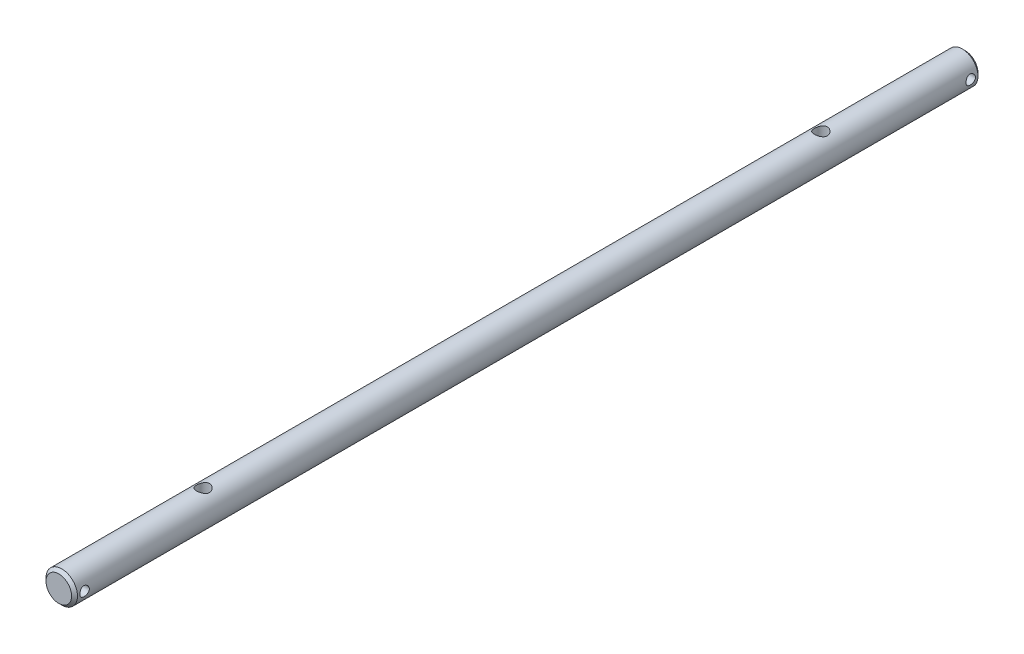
ISO-10303-21;
HEADER;
FILE_DESCRIPTION(('STEP AP214'),'2;1');
FILE_NAME('part.step','',(''),(''),'','','');
FILE_SCHEMA(('AUTOMOTIVE_DESIGN { 1 0 10303 214 1 1 1 1 }'));
ENDSEC;
DATA;
#1=APPLICATION_CONTEXT('core data for automotive mechanical design processes');
#2=APPLICATION_PROTOCOL_DEFINITION('international standard','automotive_design',2000,#1);
#3=PRODUCT_CONTEXT('',#1,'mechanical');
#4=PRODUCT('Part','Part','',(#3));
#5=PRODUCT_RELATED_PRODUCT_CATEGORY('part','',(#4));
#6=PRODUCT_DEFINITION_FORMATION('','',#4);
#7=PRODUCT_DEFINITION_CONTEXT('part definition',#1,'design');
#8=PRODUCT_DEFINITION('design','',#6,#7);
#9=PRODUCT_DEFINITION_SHAPE('','',#8);
#10=(LENGTH_UNIT() NAMED_UNIT(*) SI_UNIT(.MILLI.,.METRE.));
#11=(NAMED_UNIT(*) PLANE_ANGLE_UNIT() SI_UNIT($,.RADIAN.));
#12=(NAMED_UNIT(*) SI_UNIT($,.STERADIAN.) SOLID_ANGLE_UNIT());
#13=UNCERTAINTY_MEASURE_WITH_UNIT(LENGTH_MEASURE(1.E-05),#10,'distance_accuracy_value','');
#14=(GEOMETRIC_REPRESENTATION_CONTEXT(3) GLOBAL_UNCERTAINTY_ASSIGNED_CONTEXT((#13)) GLOBAL_UNIT_ASSIGNED_CONTEXT((#10,
#11,#12)) REPRESENTATION_CONTEXT('',''));
#15=CARTESIAN_POINT('',(0.,0.,0.));
#16=DIRECTION('',(0.,0.,1.));
#17=DIRECTION('',(1.,0.,0.));
#18=AXIS2_PLACEMENT_3D('',#15,#16,#17);
#19=CARTESIAN_POINT('',(0.,0.,457.2));
#20=DIRECTION('',(0.,0.,-1.));
#21=DIRECTION('',(-1.,0.,0.));
#22=AXIS2_PLACEMENT_3D('',#19,#20,#21);
#23=CYLINDRICAL_SURFACE('',#22,7.9375);
#24=CARTESIAN_POINT('',(0.,0.,1.41824457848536));
#25=DIRECTION('',(0.,0.,1.));
#26=DIRECTION('',(1.,0.,0.));
#27=AXIS2_PLACEMENT_3D('',#24,#25,#26);
#28=CIRCLE('',#27,7.9375);
#29=CARTESIAN_POINT('',(7.9375,0.,1.41824457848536));
#30=VERTEX_POINT('',#29);
#31=EDGE_CURVE('E129',#30,#30,#28,.T.);
#32=ORIENTED_EDGE('',*,*,#31,.T.);
#33=EDGE_LOOP('',(#32));
#34=FACE_BOUND('',#33,.T.);
#35=CARTESIAN_POINT('',(0.,-7.9375,387.6929));
#36=CARTESIAN_POINT('',(-0.0875530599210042,-7.93749934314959,387.692899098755));
#37=CARTESIAN_POINT('',(-0.175141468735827,-7.93604590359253,387.689369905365));
#38=CARTESIAN_POINT('',(-0.349674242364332,-7.93027671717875,387.675299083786));
#39=CARTESIAN_POINT('',(-0.436618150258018,-7.92595910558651,387.664752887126));
#40=CARTESIAN_POINT('',(-0.695857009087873,-7.9088288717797,387.622655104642));
#41=CARTESIAN_POINT('',(-0.86631402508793,-7.89183927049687,387.580644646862));
#42=CARTESIAN_POINT('',(-1.19655692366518,-7.84856059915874,387.470636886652));
#43=CARTESIAN_POINT('',(-1.35637647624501,-7.8223027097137,387.402726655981));
#44=CARTESIAN_POINT('',(-1.66224186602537,-7.76306120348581,387.243201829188));
#45=CARTESIAN_POINT('',(-1.808292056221,-7.73007972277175,387.151594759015));
#46=CARTESIAN_POINT('',(-2.0898325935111,-7.65888683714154,386.942516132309));
#47=CARTESIAN_POINT('',(-2.22455413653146,-7.62050707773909,386.824067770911));
#48=CARTESIAN_POINT('',(-2.47288037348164,-7.54358650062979,386.566732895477));
#49=CARTESIAN_POINT('',(-2.58647421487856,-7.50504561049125,386.427835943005));
#50=CARTESIAN_POINT('',(-2.7946567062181,-7.43011705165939,386.125522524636));
#51=CARTESIAN_POINT('',(-2.88808252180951,-7.39391935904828,385.961253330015));
#52=CARTESIAN_POINT('',(-3.04563418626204,-7.33043566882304,385.617625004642));
#53=CARTESIAN_POINT('',(-3.10977473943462,-7.30314520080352,385.438273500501));
#54=CARTESIAN_POINT('',(-3.20378358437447,-7.26238292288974,385.078411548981));
#55=CARTESIAN_POINT('',(-3.23512819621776,-7.24831904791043,384.898356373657));
#56=CARTESIAN_POINT('',(-3.26726348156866,-7.23389512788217,384.535035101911));
#57=CARTESIAN_POINT('',(-3.26807038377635,-7.23352780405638,384.351770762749));
#58=CARTESIAN_POINT('',(-3.24022153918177,-7.24603607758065,384.001762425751));
#59=CARTESIAN_POINT('',(-3.21375012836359,-7.25792988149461,383.834802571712));
#60=CARTESIAN_POINT('',(-3.13575278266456,-7.2919648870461,383.507946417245));
#61=CARTESIAN_POINT('',(-3.08422219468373,-7.3141079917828,383.348051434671));
#62=CARTESIAN_POINT('',(-2.95657151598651,-7.36664257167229,383.035883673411));
#63=CARTESIAN_POINT('',(-2.87995763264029,-7.3971975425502,382.883841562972));
#64=CARTESIAN_POINT('',(-2.70466340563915,-7.4630727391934,382.594190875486));
#65=CARTESIAN_POINT('',(-2.60597449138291,-7.49839481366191,382.456587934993));
#66=CARTESIAN_POINT('',(-2.37981547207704,-7.57335383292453,382.187831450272));
#67=CARTESIAN_POINT('',(-2.25064758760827,-7.61310693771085,382.058135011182));
#68=CARTESIAN_POINT('',(-1.97199073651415,-7.68999570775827,381.821763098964));
#69=CARTESIAN_POINT('',(-1.82249726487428,-7.72713078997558,381.715092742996));
#70=CARTESIAN_POINT('',(-1.50310308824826,-7.79562728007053,381.525739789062));
#71=CARTESIAN_POINT('',(-1.33282650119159,-7.82684408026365,381.44363505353));
#72=CARTESIAN_POINT('',(-0.979267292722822,-7.8788824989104,381.309744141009));
#73=CARTESIAN_POINT('',(-0.795991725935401,-7.89970970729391,381.257941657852));
#74=CARTESIAN_POINT('',(-0.433826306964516,-7.9275865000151,381.189141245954));
#75=CARTESIAN_POINT('',(-0.255367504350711,-7.93540929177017,381.170186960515));
#76=CARTESIAN_POINT('',(0.102336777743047,-7.93885310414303,381.161807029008));
#77=CARTESIAN_POINT('',(0.281582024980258,-7.93447751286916,381.17237318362));
#78=CARTESIAN_POINT('',(0.62670773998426,-7.91451937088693,381.221320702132));
#79=CARTESIAN_POINT('',(0.792816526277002,-7.89948546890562,381.258341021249));
#80=CARTESIAN_POINT('',(1.11629339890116,-7.86030273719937,381.357265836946));
#81=CARTESIAN_POINT('',(1.27366037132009,-7.83615274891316,381.419173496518));
#82=CARTESIAN_POINT('',(1.58067601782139,-7.78013402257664,381.568139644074));
#83=CARTESIAN_POINT('',(1.72993527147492,-7.74804959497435,381.65591700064));
#84=CARTESIAN_POINT('',(2.01213722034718,-7.67960474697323,381.853338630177));
#85=CARTESIAN_POINT('',(2.14507314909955,-7.64324256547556,381.962991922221));
#86=CARTESIAN_POINT('',(2.40058399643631,-7.56704039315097,382.209998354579));
#87=CARTESIAN_POINT('',(2.52179169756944,-7.52713460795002,382.348749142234));
#88=CARTESIAN_POINT('',(2.73956909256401,-7.45063918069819,382.645281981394));
#89=CARTESIAN_POINT('',(2.83613372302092,-7.41405022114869,382.803067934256));
#90=CARTESIAN_POINT('',(3.00277654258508,-7.34815673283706,383.136147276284));
#91=CARTESIAN_POINT('',(3.07250365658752,-7.31895036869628,383.311637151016));
#92=CARTESIAN_POINT('',(3.18084236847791,-7.27252962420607,383.673440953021));
#93=CARTESIAN_POINT('',(3.21947872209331,-7.25530570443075,383.85974614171));
#94=CARTESIAN_POINT('',(3.2621099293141,-7.23623107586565,384.222764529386));
#95=CARTESIAN_POINT('',(3.26849573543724,-7.23331975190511,384.399142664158));
#96=CARTESIAN_POINT('',(3.25279307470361,-7.24039494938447,384.750345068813));
#97=CARTESIAN_POINT('',(3.23070871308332,-7.25037961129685,384.925169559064));
#98=CARTESIAN_POINT('',(3.16068324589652,-7.28116335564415,385.260361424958));
#99=CARTESIAN_POINT('',(3.11392710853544,-7.30146537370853,385.421026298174));
#100=CARTESIAN_POINT('',(2.99702644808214,-7.35021956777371,385.732277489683));
#101=CARTESIAN_POINT('',(2.92687538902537,-7.37867402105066,385.882860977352));
#102=CARTESIAN_POINT('',(2.76038854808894,-7.44261733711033,386.179401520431));
#103=CARTESIAN_POINT('',(2.66274810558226,-7.47842299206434,386.324556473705));
#104=CARTESIAN_POINT('',(2.44589930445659,-7.55212412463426,386.597172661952));
#105=CARTESIAN_POINT('',(2.32668378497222,-7.59002029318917,386.724627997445));
#106=CARTESIAN_POINT('',(2.06016435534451,-7.6668232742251,386.967406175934));
#107=CARTESIAN_POINT('',(1.91147676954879,-7.70561451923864,387.081250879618));
#108=CARTESIAN_POINT('',(1.59555365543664,-7.77716179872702,387.282465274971));
#109=CARTESIAN_POINT('',(1.42830967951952,-7.80991506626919,387.369822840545));
#110=CARTESIAN_POINT('',(1.16866980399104,-7.85147733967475,387.477915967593));
#111=CARTESIAN_POINT('',(1.08141427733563,-7.86399724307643,387.509950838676));
#112=CARTESIAN_POINT('',(0.904186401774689,-7.88633656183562,387.566534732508));
#113=CARTESIAN_POINT('',(0.814215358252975,-7.89615725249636,387.59108729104));
#114=CARTESIAN_POINT('',(0.632474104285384,-7.91278688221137,387.632386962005));
#115=CARTESIAN_POINT('',(0.540708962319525,-7.91960330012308,387.649153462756));
#116=CARTESIAN_POINT('',(0.355946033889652,-7.93005394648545,387.674771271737));
#117=CARTESIAN_POINT('',(0.262949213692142,-7.93369053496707,387.683628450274));
#118=CARTESIAN_POINT('',(0.14148373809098,-7.93628946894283,387.689955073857));
#119=CARTESIAN_POINT('',(0.113201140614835,-7.93674317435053,387.69105911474));
#120=CARTESIAN_POINT('',(0.0566135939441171,-7.93734854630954,387.692531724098));
#121=CARTESIAN_POINT('',(0.0283086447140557,-7.9375002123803,387.692900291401));
#122=CARTESIAN_POINT('',(0.,-7.9375,387.6929));
#123=B_SPLINE_CURVE_WITH_KNOTS('',3,(#35,#36,#37,#38,#39,#40,#41,#42,#43,#44,#45,#46,#47,#48,
#49,#50,#51,#52,#53,#54,#55,#56,#57,#58,#59,#60,#61,#62,#63,#64,#65,#66,#67,#68,#69,#70,#71,#72,
#73,#74,#75,#76,#77,#78,#79,#80,#81,#82,#83,#84,#85,#86,#87,#88,#89,#90,#91,#92,#93,#94,#95,#96,
#97,#98,#99,#100,#101,#102,#103,#104,#105,#106,#107,#108,#109,#110,#111,#112,#113,#114,#115,
#116,#117,#118,#119,#120,#121,#122),.UNSPECIFIED.,.T.,.F.,(4,2,2,2,2,2,2,2,2,2,2,2,2,2,2,2,2,2,
2,2,2,2,2,2,2,2,2,2,2,2,2,2,2,2,2,2,2,2,2,2,2,2,2,4),(0.,0.262627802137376,0.525426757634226,
1.05175013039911,1.57631944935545,2.10072237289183,2.64867604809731,3.19691041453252,
3.77125564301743,4.34531217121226,4.89224140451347,5.43887997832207,5.94490860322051,
6.45103122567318,6.96778553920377,7.48474083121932,8.04414010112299,8.60366356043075,
9.17546733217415,9.74696312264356,10.2830744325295,10.8190368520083,11.329243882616,
11.8395157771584,12.3655746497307,12.891850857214,13.4547946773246,14.0178540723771,
14.5880472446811,15.1577859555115,15.6845933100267,16.2113247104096,16.7147943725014,
17.2184048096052,17.7518396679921,18.2854519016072,18.8564940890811,19.4277973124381,
19.7088571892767,19.98978404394,20.2700075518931,20.5500229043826,20.6349385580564,
20.71985434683),.UNSPECIFIED.);
#124=CARTESIAN_POINT('',(0.,-7.9375,387.6929));
#125=VERTEX_POINT('',#124);
#126=EDGE_CURVE('E10',#125,#125,#123,.T.);
#127=ORIENTED_EDGE('',*,*,#126,.F.);
#128=EDGE_LOOP('',(#127));
#129=FACE_BOUND('',#128,.T.);
#130=CARTESIAN_POINT('',(0.,7.9375,387.6929));
#131=CARTESIAN_POINT('',(0.0875530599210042,7.93749934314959,387.692899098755));
#132=CARTESIAN_POINT('',(0.175141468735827,7.93604590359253,387.689369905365));
#133=CARTESIAN_POINT('',(0.349674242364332,7.93027671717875,387.675299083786));
#134=CARTESIAN_POINT('',(0.436618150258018,7.92595910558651,387.664752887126));
#135=CARTESIAN_POINT('',(0.695857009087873,7.9088288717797,387.622655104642));
#136=CARTESIAN_POINT('',(0.86631402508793,7.89183927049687,387.580644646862));
#137=CARTESIAN_POINT('',(1.19655692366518,7.84856059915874,387.470636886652));
#138=CARTESIAN_POINT('',(1.35637647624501,7.8223027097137,387.402726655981));
#139=CARTESIAN_POINT('',(1.66224186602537,7.76306120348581,387.243201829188));
#140=CARTESIAN_POINT('',(1.808292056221,7.73007972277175,387.151594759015));
#141=CARTESIAN_POINT('',(2.0898325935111,7.65888683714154,386.942516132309));
#142=CARTESIAN_POINT('',(2.22455413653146,7.62050707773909,386.824067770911));
#143=CARTESIAN_POINT('',(2.47288037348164,7.54358650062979,386.566732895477));
#144=CARTESIAN_POINT('',(2.58647421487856,7.50504561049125,386.427835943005));
#145=CARTESIAN_POINT('',(2.7946567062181,7.43011705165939,386.125522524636));
#146=CARTESIAN_POINT('',(2.88808252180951,7.39391935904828,385.961253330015));
#147=CARTESIAN_POINT('',(3.04563418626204,7.33043566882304,385.617625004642));
#148=CARTESIAN_POINT('',(3.10977473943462,7.30314520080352,385.438273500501));
#149=CARTESIAN_POINT('',(3.20378358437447,7.26238292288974,385.078411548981));
#150=CARTESIAN_POINT('',(3.23512819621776,7.24831904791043,384.898356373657));
#151=CARTESIAN_POINT('',(3.26726348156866,7.23389512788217,384.535035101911));
#152=CARTESIAN_POINT('',(3.26807038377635,7.23352780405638,384.351770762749));
#153=CARTESIAN_POINT('',(3.24022153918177,7.24603607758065,384.001762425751));
#154=CARTESIAN_POINT('',(3.21375012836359,7.25792988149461,383.834802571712));
#155=CARTESIAN_POINT('',(3.13575278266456,7.2919648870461,383.507946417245));
#156=CARTESIAN_POINT('',(3.08422219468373,7.3141079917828,383.348051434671));
#157=CARTESIAN_POINT('',(2.95657151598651,7.36664257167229,383.035883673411));
#158=CARTESIAN_POINT('',(2.87995763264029,7.3971975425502,382.883841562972));
#159=CARTESIAN_POINT('',(2.70466340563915,7.4630727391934,382.594190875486));
#160=CARTESIAN_POINT('',(2.60597449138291,7.49839481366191,382.456587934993));
#161=CARTESIAN_POINT('',(2.37981547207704,7.57335383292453,382.187831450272));
#162=CARTESIAN_POINT('',(2.25064758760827,7.61310693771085,382.058135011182));
#163=CARTESIAN_POINT('',(1.97199073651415,7.68999570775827,381.821763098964));
#164=CARTESIAN_POINT('',(1.82249726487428,7.72713078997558,381.715092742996));
#165=CARTESIAN_POINT('',(1.50310308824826,7.79562728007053,381.525739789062));
#166=CARTESIAN_POINT('',(1.33282650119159,7.82684408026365,381.44363505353));
#167=CARTESIAN_POINT('',(0.979267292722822,7.8788824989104,381.309744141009));
#168=CARTESIAN_POINT('',(0.795991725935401,7.89970970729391,381.257941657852));
#169=CARTESIAN_POINT('',(0.433826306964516,7.9275865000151,381.189141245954));
#170=CARTESIAN_POINT('',(0.255367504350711,7.93540929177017,381.170186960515));
#171=CARTESIAN_POINT('',(-0.102336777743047,7.93885310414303,381.161807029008));
#172=CARTESIAN_POINT('',(-0.281582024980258,7.93447751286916,381.17237318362));
#173=CARTESIAN_POINT('',(-0.62670773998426,7.91451937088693,381.221320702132));
#174=CARTESIAN_POINT('',(-0.792816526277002,7.89948546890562,381.258341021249));
#175=CARTESIAN_POINT('',(-1.11629339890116,7.86030273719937,381.357265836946));
#176=CARTESIAN_POINT('',(-1.27366037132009,7.83615274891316,381.419173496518));
#177=CARTESIAN_POINT('',(-1.58067601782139,7.78013402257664,381.568139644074));
#178=CARTESIAN_POINT('',(-1.72993527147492,7.74804959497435,381.65591700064));
#179=CARTESIAN_POINT('',(-2.01213722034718,7.67960474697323,381.853338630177));
#180=CARTESIAN_POINT('',(-2.14507314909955,7.64324256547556,381.962991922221));
#181=CARTESIAN_POINT('',(-2.40058399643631,7.56704039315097,382.209998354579));
#182=CARTESIAN_POINT('',(-2.52179169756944,7.52713460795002,382.348749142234));
#183=CARTESIAN_POINT('',(-2.73956909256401,7.45063918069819,382.645281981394));
#184=CARTESIAN_POINT('',(-2.83613372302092,7.41405022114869,382.803067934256));
#185=CARTESIAN_POINT('',(-3.00277654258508,7.34815673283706,383.136147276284));
#186=CARTESIAN_POINT('',(-3.07250365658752,7.31895036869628,383.311637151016));
#187=CARTESIAN_POINT('',(-3.18084236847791,7.27252962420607,383.673440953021));
#188=CARTESIAN_POINT('',(-3.21947872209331,7.25530570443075,383.85974614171));
#189=CARTESIAN_POINT('',(-3.2621099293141,7.23623107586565,384.222764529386));
#190=CARTESIAN_POINT('',(-3.26849573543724,7.23331975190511,384.399142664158));
#191=CARTESIAN_POINT('',(-3.25279307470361,7.24039494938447,384.750345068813));
#192=CARTESIAN_POINT('',(-3.23070871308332,7.25037961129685,384.925169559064));
#193=CARTESIAN_POINT('',(-3.16068324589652,7.28116335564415,385.260361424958));
#194=CARTESIAN_POINT('',(-3.11392710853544,7.30146537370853,385.421026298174));
#195=CARTESIAN_POINT('',(-2.99702644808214,7.35021956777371,385.732277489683));
#196=CARTESIAN_POINT('',(-2.92687538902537,7.37867402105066,385.882860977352));
#197=CARTESIAN_POINT('',(-2.76038854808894,7.44261733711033,386.179401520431));
#198=CARTESIAN_POINT('',(-2.66274810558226,7.47842299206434,386.324556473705));
#199=CARTESIAN_POINT('',(-2.44589930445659,7.55212412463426,386.597172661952));
#200=CARTESIAN_POINT('',(-2.32668378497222,7.59002029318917,386.724627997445));
#201=CARTESIAN_POINT('',(-2.06016435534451,7.6668232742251,386.967406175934));
#202=CARTESIAN_POINT('',(-1.91147676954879,7.70561451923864,387.081250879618));
#203=CARTESIAN_POINT('',(-1.59555365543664,7.77716179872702,387.282465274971));
#204=CARTESIAN_POINT('',(-1.42830967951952,7.80991506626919,387.369822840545));
#205=CARTESIAN_POINT('',(-1.16866980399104,7.85147733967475,387.477915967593));
#206=CARTESIAN_POINT('',(-1.08141427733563,7.86399724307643,387.509950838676));
#207=CARTESIAN_POINT('',(-0.904186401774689,7.88633656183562,387.566534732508));
#208=CARTESIAN_POINT('',(-0.814215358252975,7.89615725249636,387.59108729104));
#209=CARTESIAN_POINT('',(-0.632474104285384,7.91278688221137,387.632386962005));
#210=CARTESIAN_POINT('',(-0.540708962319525,7.91960330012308,387.649153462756));
#211=CARTESIAN_POINT('',(-0.355946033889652,7.93005394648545,387.674771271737));
#212=CARTESIAN_POINT('',(-0.262949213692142,7.93369053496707,387.683628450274));
#213=CARTESIAN_POINT('',(-0.14148373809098,7.93628946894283,387.689955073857));
#214=CARTESIAN_POINT('',(-0.113201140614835,7.93674317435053,387.69105911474));
#215=CARTESIAN_POINT('',(-0.0566135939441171,7.93734854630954,387.692531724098));
#216=CARTESIAN_POINT('',(-0.0283086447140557,7.9375002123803,387.692900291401));
#217=CARTESIAN_POINT('',(0.,7.9375,387.6929));
#218=B_SPLINE_CURVE_WITH_KNOTS('',3,(#130,#131,#132,#133,#134,#135,#136,#137,#138,#139,#140,
#141,#142,#143,#144,#145,#146,#147,#148,#149,#150,#151,#152,#153,#154,#155,#156,#157,#158,#159,
#160,#161,#162,#163,#164,#165,#166,#167,#168,#169,#170,#171,#172,#173,#174,#175,#176,#177,#178,
#179,#180,#181,#182,#183,#184,#185,#186,#187,#188,#189,#190,#191,#192,#193,#194,#195,#196,#197,
#198,#199,#200,#201,#202,#203,#204,#205,#206,#207,#208,#209,#210,#211,#212,#213,#214,#215,#216,
#217),.UNSPECIFIED.,.T.,.F.,(4,2,2,2,2,2,2,2,2,2,2,2,2,2,2,2,2,2,2,2,2,2,2,2,2,2,2,2,2,2,2,2,2,
2,2,2,2,2,2,2,2,2,2,4),(0.,0.262627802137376,0.525426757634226,1.05175013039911,
1.57631944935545,2.10072237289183,2.64867604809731,3.19691041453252,3.77125564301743,
4.34531217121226,4.89224140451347,5.43887997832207,5.94490860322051,6.45103122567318,
6.96778553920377,7.48474083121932,8.04414010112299,8.60366356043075,9.17546733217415,
9.74696312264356,10.2830744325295,10.8190368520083,11.329243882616,11.8395157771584,
12.3655746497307,12.891850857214,13.4547946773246,14.0178540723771,14.5880472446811,
15.1577859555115,15.6845933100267,16.2113247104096,16.7147943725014,17.2184048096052,
17.7518396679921,18.2854519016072,18.8564940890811,19.4277973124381,19.7088571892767,
19.98978404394,20.2700075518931,20.5500229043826,20.6349385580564,20.71985434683),.UNSPECIFIED.);
#219=CARTESIAN_POINT('',(0.,7.9375,387.6929));
#220=VERTEX_POINT('',#219);
#221=EDGE_CURVE('E40',#220,#220,#218,.T.);
#222=ORIENTED_EDGE('',*,*,#221,.F.);
#223=EDGE_LOOP('',(#222));
#224=FACE_BOUND('',#223,.T.);
#225=CARTESIAN_POINT('',(-7.9375,0.,454.496487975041));
#226=CARTESIAN_POINT('',(-7.93749885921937,0.130060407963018,454.504724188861));
#227=CARTESIAN_POINT('',(-7.93427273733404,0.260814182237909,454.502252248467));
#228=CARTESIAN_POINT('',(-7.92151980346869,0.519870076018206,454.476033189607));
#229=CARTESIAN_POINT('',(-7.91199142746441,0.648171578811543,454.45228078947));
#230=CARTESIAN_POINT('',(-7.8874829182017,0.898513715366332,454.384432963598));
#231=CARTESIAN_POINT('',(-7.87251040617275,1.02056283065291,454.34036595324));
#232=CARTESIAN_POINT('',(-7.83848643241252,1.25544317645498,454.233330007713));
#233=CARTESIAN_POINT('',(-7.81943439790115,1.36827310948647,454.170358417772));
#234=CARTESIAN_POINT('',(-7.77849192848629,1.58474696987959,454.025450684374));
#235=CARTESIAN_POINT('',(-7.75654140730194,1.68808252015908,453.943071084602));
#236=CARTESIAN_POINT('',(-7.71234166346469,1.8797293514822,453.762418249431));
#237=CARTESIAN_POINT('',(-7.690092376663,1.96803734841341,453.664141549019));
#238=CARTESIAN_POINT('',(-7.64691682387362,2.12974017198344,453.450961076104));
#239=CARTESIAN_POINT('',(-7.6260488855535,2.20261869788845,453.335652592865));
#240=CARTESIAN_POINT('',(-7.58876151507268,2.32785252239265,453.093714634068));
#241=CARTESIAN_POINT('',(-7.57234121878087,2.38021180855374,452.967087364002));
#242=CARTESIAN_POINT('',(-7.54627824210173,2.46158237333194,452.709220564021));
#243=CARTESIAN_POINT('',(-7.53648279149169,2.49112233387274,452.578163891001));
#244=CARTESIAN_POINT('',(-7.52428089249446,2.5277442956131,452.312628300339));
#245=CARTESIAN_POINT('',(-7.52187192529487,2.53483395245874,452.178150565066));
#246=CARTESIAN_POINT('',(-7.52467951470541,2.52648169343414,451.916141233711));
#247=CARTESIAN_POINT('',(-7.52955374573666,2.51205132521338,451.788572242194));
#248=CARTESIAN_POINT('',(-7.54572894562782,2.46303428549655,451.537799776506));
#249=CARTESIAN_POINT('',(-7.55703023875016,2.42844659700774,451.414596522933));
#250=CARTESIAN_POINT('',(-7.58483517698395,2.34015242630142,451.17545363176));
#251=CARTESIAN_POINT('',(-7.60135507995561,2.28638612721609,451.059538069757));
#252=CARTESIAN_POINT('',(-7.63784758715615,2.161346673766,450.838164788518));
#253=CARTESIAN_POINT('',(-7.65782103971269,2.09006921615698,450.732709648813));
#254=CARTESIAN_POINT('',(-7.70022844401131,1.92813362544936,450.530017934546));
#255=CARTESIAN_POINT('',(-7.72273369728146,1.83672679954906,450.43339382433));
#256=CARTESIAN_POINT('',(-7.76709318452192,1.6390304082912,450.256594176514));
#257=CARTESIAN_POINT('',(-7.78894730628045,1.53273829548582,450.176421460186));
#258=CARTESIAN_POINT('',(-7.83029675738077,1.30536765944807,450.033104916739));
#259=CARTESIAN_POINT('',(-7.84972874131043,1.18401262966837,449.970379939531));
#260=CARTESIAN_POINT('',(-7.88364572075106,0.931773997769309,449.86642739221));
#261=CARTESIAN_POINT('',(-7.89813187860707,0.800892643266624,449.825194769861));
#262=CARTESIAN_POINT('',(-7.92034853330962,0.537509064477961,449.766654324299));
#263=CARTESIAN_POINT('',(-7.92827020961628,0.405175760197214,449.748660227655));
#264=CARTESIAN_POINT('',(-7.93739524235,0.139144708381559,449.735057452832));
#265=CARTESIAN_POINT('',(-7.93860006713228,0.0054472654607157,449.739443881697));
#266=CARTESIAN_POINT('',(-7.93444336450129,-0.254718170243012,449.76995546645));
#267=CARTESIAN_POINT('',(-7.92930287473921,-0.381277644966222,449.795339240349));
#268=CARTESIAN_POINT('',(-7.91356058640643,-0.628327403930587,449.866057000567));
#269=CARTESIAN_POINT('',(-7.9029584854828,-0.748817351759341,449.911392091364));
#270=CARTESIAN_POINT('',(-7.87743576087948,-0.981727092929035,450.021164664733));
#271=CARTESIAN_POINT('',(-7.86247308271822,-1.09405431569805,450.085788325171));
#272=CARTESIAN_POINT('',(-7.82997081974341,-1.30653506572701,450.2321461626));
#273=CARTESIAN_POINT('',(-7.81243065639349,-1.40668585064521,450.313884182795));
#274=CARTESIAN_POINT('',(-7.77604605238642,-1.5958183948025,450.495661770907));
#275=CARTESIAN_POINT('',(-7.75717737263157,-1.68425837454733,450.596260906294));
#276=CARTESIAN_POINT('',(-7.72096440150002,-1.84317018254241,450.811032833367));
#277=CARTESIAN_POINT('',(-7.70362023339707,-1.91364055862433,450.925206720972));
#278=CARTESIAN_POINT('',(-7.67242891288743,-2.03512359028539,451.165244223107));
#279=CARTESIAN_POINT('',(-7.65861420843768,-2.08595775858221,451.291202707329));
#280=CARTESIAN_POINT('',(-7.63649057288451,-2.16555899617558,451.550361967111));
#281=CARTESIAN_POINT('',(-7.62818006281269,-2.19433239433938,451.683560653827));
#282=CARTESIAN_POINT('',(-7.61835876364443,-2.2281871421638,451.948656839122));
#283=CARTESIAN_POINT('',(-7.61663048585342,-2.23402648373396,452.080449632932));
#284=CARTESIAN_POINT('',(-7.61959525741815,-2.2238934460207,452.34311018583));
#285=CARTESIAN_POINT('',(-7.62428764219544,-2.20792332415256,452.473978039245));
#286=CARTESIAN_POINT('',(-7.6393250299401,-2.1553041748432,452.728315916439));
#287=CARTESIAN_POINT('',(-7.64955233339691,-2.11908522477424,452.851882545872));
#288=CARTESIAN_POINT('',(-7.67434774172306,-2.02744483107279,453.091207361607));
#289=CARTESIAN_POINT('',(-7.68891649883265,-1.97202050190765,453.206964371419));
#290=CARTESIAN_POINT('',(-7.72114806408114,-1.84184071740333,453.430741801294));
#291=CARTESIAN_POINT('',(-7.73888239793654,-1.76661357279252,453.538477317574));
#292=CARTESIAN_POINT('',(-7.77512584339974,-1.59956724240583,453.74008947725));
#293=CARTESIAN_POINT('',(-7.79363515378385,-1.50774377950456,453.83396253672));
#294=CARTESIAN_POINT('',(-7.82988164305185,-1.30674663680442,454.008104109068));
#295=CARTESIAN_POINT('',(-7.84757796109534,-1.19712862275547,454.087869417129));
#296=CARTESIAN_POINT('',(-7.87941367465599,-0.965591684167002,454.227824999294));
#297=CARTESIAN_POINT('',(-7.8935544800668,-0.843677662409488,454.288023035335));
#298=CARTESIAN_POINT('',(-7.91538795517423,-0.603080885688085,454.382187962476));
#299=CARTESIAN_POINT('',(-7.92356846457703,-0.485206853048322,454.418114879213));
#300=CARTESIAN_POINT('',(-7.9346245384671,-0.245094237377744,454.471373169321));
#301=CARTESIAN_POINT('',(-7.93750107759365,-0.122856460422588,454.488707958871));
#302=CARTESIAN_POINT('',(-7.9375,0.,454.496487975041));
#303=B_SPLINE_CURVE_WITH_KNOTS('',3,(#225,#226,#227,#228,#229,#230,#231,#232,#233,#234,#235,
#236,#237,#238,#239,#240,#241,#242,#243,#244,#245,#246,#247,#248,#249,#250,#251,#252,#253,#254,
#255,#256,#257,#258,#259,#260,#261,#262,#263,#264,#265,#266,#267,#268,#269,#270,#271,#272,#273,
#274,#275,#276,#277,#278,#279,#280,#281,#282,#283,#284,#285,#286,#287,#288,#289,#290,#291,#292,
#293,#294,#295,#296,#297,#298,#299,#300,#301,#302),.UNSPECIFIED.,.T.,.F.,(4,2,2,2,2,2,2,2,2,2,2,
2,2,2,2,2,2,2,2,2,2,2,2,2,2,2,2,2,2,2,2,2,2,2,2,2,2,2,4),(0.,0.390513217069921,
0.781123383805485,1.17118882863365,1.56130907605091,1.96139739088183,2.36157302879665,
2.7735441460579,3.18543516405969,3.58747066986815,3.98936906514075,4.37296201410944,
4.75657431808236,5.14139369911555,5.52630774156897,5.92916895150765,6.3320991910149,
6.74399984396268,7.15580362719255,7.55514499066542,7.95439905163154,8.34012930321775,
8.72588091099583,9.11548340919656,9.50517349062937,9.90910168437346,10.3130625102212,
10.7206133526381,11.1280472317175,11.5218957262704,11.9157034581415,12.3014483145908,
12.6872511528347,13.0832386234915,13.4793282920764,13.8875179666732,14.2955455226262,
14.6644963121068,15.0333792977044),.UNSPECIFIED.);
#304=CARTESIAN_POINT('',(-7.9375,0.,454.496487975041));
#305=VERTEX_POINT('',#304);
#306=EDGE_CURVE('E83',#305,#305,#303,.T.);
#307=ORIENTED_EDGE('',*,*,#306,.F.);
#308=EDGE_LOOP('',(#307));
#309=FACE_BOUND('',#308,.T.);
#310=CARTESIAN_POINT('',(7.93607269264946,0.150520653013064,449.73875));
#311=CARTESIAN_POINT('',(7.93358511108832,0.281603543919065,449.738751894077));
#312=CARTESIAN_POINT('',(7.92782086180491,0.412643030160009,449.749610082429));
#313=CARTESIAN_POINT('',(7.91016586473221,0.670778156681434,449.792593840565));
#314=CARTESIAN_POINT('',(7.89827294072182,0.79787237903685,449.824726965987));
#315=CARTESIAN_POINT('',(7.86947235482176,1.04436357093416,449.909041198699));
#316=CARTESIAN_POINT('',(7.85257287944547,1.16377272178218,449.961189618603));
#317=CARTESIAN_POINT('',(7.815327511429,1.39210723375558,450.083919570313));
#318=CARTESIAN_POINT('',(7.79498117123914,1.50103123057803,450.154503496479));
#319=CARTESIAN_POINT('',(7.75214805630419,1.70870506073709,450.314433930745));
#320=CARTESIAN_POINT('',(7.72961715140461,1.80708218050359,450.404252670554));
#321=CARTESIAN_POINT('',(7.68518071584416,1.98760248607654,450.599103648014));
#322=CARTESIAN_POINT('',(7.66327529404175,2.06974286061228,450.704138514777));
#323=CARTESIAN_POINT('',(7.62196578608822,2.21710135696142,450.929179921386));
#324=CARTESIAN_POINT('',(7.60262318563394,2.28193207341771,451.049452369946));
#325=CARTESIAN_POINT('',(7.56926567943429,2.39026369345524,451.299935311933));
#326=CARTESIAN_POINT('',(7.55524921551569,2.43377083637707,451.43014288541));
#327=CARTESIAN_POINT('',(7.53466635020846,2.49675386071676,451.692131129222));
#328=CARTESIAN_POINT('',(7.52786368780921,2.51699379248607,451.823709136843));
#329=CARTESIAN_POINT('',(7.52173372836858,2.53525744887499,452.088555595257));
#330=CARTESIAN_POINT('',(7.52240442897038,2.5332871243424,452.221823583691));
#331=CARTESIAN_POINT('',(7.53095152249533,2.50775456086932,452.480594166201));
#332=CARTESIAN_POINT('',(7.53853755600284,2.48506232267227,452.606193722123));
#333=CARTESIAN_POINT('',(7.55963401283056,2.42012272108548,452.851700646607));
#334=CARTESIAN_POINT('',(7.57314506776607,2.377873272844,452.971607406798));
#335=CARTESIAN_POINT('',(7.60487693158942,2.2743598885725,453.204507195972));
#336=CARTESIAN_POINT('',(7.62316828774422,2.2128081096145,453.317362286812));
#337=CARTESIAN_POINT('',(7.66245868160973,2.07265956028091,453.531421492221));
#338=CARTESIAN_POINT('',(7.68345843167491,1.99405830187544,453.63262252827));
#339=CARTESIAN_POINT('',(7.72713690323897,1.81765948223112,453.825543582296));
#340=CARTESIAN_POINT('',(7.74984803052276,1.71912876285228,453.91658706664));
#341=CARTESIAN_POINT('',(7.79368696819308,1.50796664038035,454.081020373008));
#342=CARTESIAN_POINT('',(7.8148146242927,1.39533386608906,454.154408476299));
#343=CARTESIAN_POINT('',(7.85358156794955,1.15750515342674,454.282115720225));
#344=CARTESIAN_POINT('',(7.87117983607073,1.03218441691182,454.336215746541));
#345=CARTESIAN_POINT('',(7.90078710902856,0.773551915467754,454.422334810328));
#346=CARTESIAN_POINT('',(7.91279769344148,0.640242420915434,454.454360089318));
#347=CARTESIAN_POINT('',(7.92973078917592,0.374617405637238,454.494343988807));
#348=CARTESIAN_POINT('',(7.93489587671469,0.24244301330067,454.503137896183));
#349=CARTESIAN_POINT('',(7.93856815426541,-0.0216157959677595,454.498686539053));
#350=CARTESIAN_POINT('',(7.93707642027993,-0.153500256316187,454.48544483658));
#351=CARTESIAN_POINT('',(7.92793719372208,-0.409508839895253,454.438019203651));
#352=CARTESIAN_POINT('',(7.92045703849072,-0.533746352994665,454.404410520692));
#353=CARTESIAN_POINT('',(7.90051665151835,-0.774846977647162,454.317830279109));
#354=CARTESIAN_POINT('',(7.88805592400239,-0.891709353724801,454.264856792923));
#355=CARTESIAN_POINT('',(7.85932081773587,-1.11720969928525,454.139935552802));
#356=CARTESIAN_POINT('',(7.84297892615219,-1.22565091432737,454.067648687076));
#357=CARTESIAN_POINT('',(7.80846140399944,-1.42916369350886,453.906561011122));
#358=CARTESIAN_POINT('',(7.79028534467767,-1.52423211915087,453.817756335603));
#359=CARTESIAN_POINT('',(7.75347612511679,-1.701773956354,453.62245672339));
#360=CARTESIAN_POINT('',(7.73484944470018,-1.78368508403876,453.515448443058));
#361=CARTESIAN_POINT('',(7.70003293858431,-1.92846130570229,453.288870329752));
#362=CARTESIAN_POINT('',(7.68384309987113,-1.99132650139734,453.169300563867));
#363=CARTESIAN_POINT('',(7.65594640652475,-2.0960299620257,452.92093490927));
#364=CARTESIAN_POINT('',(7.64423431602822,-2.13789280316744,452.792150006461));
#365=CARTESIAN_POINT('',(7.62681609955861,-2.19923115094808,452.528974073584));
#366=CARTESIAN_POINT('',(7.62110819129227,-2.21871330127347,452.394584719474));
#367=CARTESIAN_POINT('',(7.61655756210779,-2.23428207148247,452.129255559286));
#368=CARTESIAN_POINT('',(7.6174730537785,-2.23119262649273,451.998367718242));
#369=CARTESIAN_POINT('',(7.62547882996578,-2.20367409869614,451.739057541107));
#370=CARTESIAN_POINT('',(7.63256889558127,-2.17924577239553,451.610635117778));
#371=CARTESIAN_POINT('',(7.65191757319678,-2.11028787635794,451.361283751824));
#372=CARTESIAN_POINT('',(7.66411810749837,-2.06598379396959,451.240287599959));
#373=CARTESIAN_POINT('',(7.69223402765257,-1.95869931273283,451.007348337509));
#374=CARTESIAN_POINT('',(7.70815007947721,-1.89571556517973,450.895406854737));
#375=CARTESIAN_POINT('',(7.74245180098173,-1.75045107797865,450.679828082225));
#376=CARTESIAN_POINT('',(7.76090083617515,-1.66761062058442,450.57657798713));
#377=CARTESIAN_POINT('',(7.79771481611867,-1.48597527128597,450.385166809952));
#378=CARTESIAN_POINT('',(7.81607974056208,-1.38717671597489,450.297009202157));
#379=CARTESIAN_POINT('',(7.85102490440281,-1.17357760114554,450.136215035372));
#380=CARTESIAN_POINT('',(7.86755243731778,-1.05845288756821,450.063996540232));
#381=CARTESIAN_POINT('',(7.89625337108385,-0.817194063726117,449.940034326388));
#382=CARTESIAN_POINT('',(7.90842897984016,-0.691065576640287,449.888280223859));
#383=CARTESIAN_POINT('',(7.92576959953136,-0.446476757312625,449.811661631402));
#384=CARTESIAN_POINT('',(7.93158210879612,-0.328814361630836,449.7843810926));
#385=CARTESIAN_POINT('',(7.93787697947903,-0.0905819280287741,449.747925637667));
#386=CARTESIAN_POINT('',(7.93836006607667,0.0299877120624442,449.738748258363));
#387=CARTESIAN_POINT('',(7.93607269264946,0.150520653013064,449.73875));
#388=B_SPLINE_CURVE_WITH_KNOTS('',3,(#310,#311,#312,#313,#314,#315,#316,#317,#318,#319,#320,
#321,#322,#323,#324,#325,#326,#327,#328,#329,#330,#331,#332,#333,#334,#335,#336,#337,#338,#339,
#340,#341,#342,#343,#344,#345,#346,#347,#348,#349,#350,#351,#352,#353,#354,#355,#356,#357,#358,
#359,#360,#361,#362,#363,#364,#365,#366,#367,#368,#369,#370,#371,#372,#373,#374,#375,#376,#377,
#378,#379,#380,#381,#382,#383,#384,#385,#386,#387),.UNSPECIFIED.,.T.,.F.,(4,2,2,2,2,2,2,2,2,2,2,
2,2,2,2,2,2,2,2,2,2,2,2,2,2,2,2,2,2,2,2,2,2,2,2,2,2,2,4),(0.,0.392873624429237,
0.785886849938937,1.17826094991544,1.57068603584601,1.97415781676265,2.37769939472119,
2.78963236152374,3.20144472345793,3.59930857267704,3.99706582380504,4.37885478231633,
4.76068444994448,5.14850300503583,5.53642377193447,5.9427270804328,6.34906992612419,
6.75989188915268,7.17059764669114,7.56632172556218,7.96198184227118,8.34695631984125,
8.73196912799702,9.12424554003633,9.51661386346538,9.92281685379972,10.3290176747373,
10.7347420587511,11.1403459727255,11.5312200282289,11.9220802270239,12.3086141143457,
12.695217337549,13.0943620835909,13.4935985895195,13.9023111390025,14.3108160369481,
14.672119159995,15.0333731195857),.UNSPECIFIED.);
#389=CARTESIAN_POINT('',(7.93607269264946,0.150520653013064,449.73875));
#390=VERTEX_POINT('',#389);
#391=EDGE_CURVE('E87',#390,#390,#388,.T.);
#392=ORIENTED_EDGE('',*,*,#391,.F.);
#393=EDGE_LOOP('',(#392));
#394=FACE_BOUND('',#393,.T.);
#395=CARTESIAN_POINT('',(7.93607269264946,0.150520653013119,2.69875000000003));
#396=CARTESIAN_POINT('',(7.93854156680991,0.0203059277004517,2.69875126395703));
#397=CARTESIAN_POINT('',(7.93777726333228,-0.109983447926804,2.70946578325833));
#398=CARTESIAN_POINT('',(7.9300585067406,-0.366894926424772,2.75199750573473));
#399=CARTESIAN_POINT('',(7.92310255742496,-0.49351613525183,2.78381980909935));
#400=CARTESIAN_POINT('',(7.90395291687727,-0.739342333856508,2.86746000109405));
#401=CARTESIAN_POINT('',(7.89176611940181,-0.858556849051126,2.91925156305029));
#402=CARTESIAN_POINT('',(7.86360672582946,-1.08665561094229,3.04125438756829));
#403=CARTESIAN_POINT('',(7.84763361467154,-1.19553844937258,3.11146815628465));
#404=CARTESIAN_POINT('',(7.81329362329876,-1.40272820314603,3.2702479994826));
#405=CARTESIAN_POINT('',(7.79487927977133,-1.50072615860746,3.35920686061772));
#406=CARTESIAN_POINT('',(7.75807065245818,-1.68068444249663,3.55211110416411));
#407=CARTESIAN_POINT('',(7.73967637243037,-1.76264215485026,3.65605892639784));
#408=CARTESIAN_POINT('',(7.70462771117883,-1.91010891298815,3.87898582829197));
#409=CARTESIAN_POINT('',(7.68802527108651,-1.97517918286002,3.99826420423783));
#410=CARTESIAN_POINT('',(7.65918084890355,-2.0842406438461,4.24658959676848));
#411=CARTESIAN_POINT('',(7.64693802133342,-2.12823592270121,4.37563471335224));
#412=CARTESIAN_POINT('',(7.62864664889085,-2.19289101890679,4.63676933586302));
#413=CARTESIAN_POINT('',(7.6224644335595,-2.21405549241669,4.76872423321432));
#414=CARTESIAN_POINT('',(7.61663919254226,-2.2340166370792,5.03444551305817));
#415=CARTESIAN_POINT('',(7.61699474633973,-2.23281816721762,5.16821149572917));
#416=CARTESIAN_POINT('',(7.62407457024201,-2.20851408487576,5.42918670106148));
#417=CARTESIAN_POINT('',(7.6305932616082,-2.18611559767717,5.55646831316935));
#418=CARTESIAN_POINT('',(7.6488918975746,-2.12119891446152,5.80538979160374));
#419=CARTESIAN_POINT('',(7.66067232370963,-2.07867887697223,5.92702914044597));
#420=CARTESIAN_POINT('',(7.68825837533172,-1.9742153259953,6.16290719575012));
#421=CARTESIAN_POINT('',(7.70411035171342,-1.9120461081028,6.27704028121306));
#422=CARTESIAN_POINT('',(7.73793553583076,-1.77018742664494,6.49350138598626));
#423=CARTESIAN_POINT('',(7.7559092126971,-1.6904940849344,6.59582678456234));
#424=CARTESIAN_POINT('',(7.79263325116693,-1.51238923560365,6.78968719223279));
#425=CARTESIAN_POINT('',(7.81138802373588,-1.41340086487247,6.88069228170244));
#426=CARTESIAN_POINT('',(7.84680489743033,-1.20129212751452,7.04492848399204));
#427=CARTESIAN_POINT('',(7.86346693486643,-1.08817133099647,7.11815905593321));
#428=CARTESIAN_POINT('',(7.8927193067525,-0.850441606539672,7.24485833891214));
#429=CARTESIAN_POINT('',(7.90529840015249,-0.725802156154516,7.29827254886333));
#430=CARTESIAN_POINT('',(7.92468544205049,-0.468867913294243,7.38325968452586));
#431=CARTESIAN_POINT('',(7.93149496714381,-0.336575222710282,7.41483857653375));
#432=CARTESIAN_POINT('',(7.93821918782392,-0.0730824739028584,7.4543370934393));
#433=CARTESIAN_POINT('',(7.93836709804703,0.0579934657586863,7.46304690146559));
#434=CARTESIAN_POINT('',(7.93214094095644,0.319630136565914,7.45883732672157));
#435=CARTESIAN_POINT('',(7.92576756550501,0.45019092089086,7.44592023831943));
#436=CARTESIAN_POINT('',(7.90717104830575,0.704661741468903,7.39942049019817));
#437=CARTESIAN_POINT('',(7.89505595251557,0.828649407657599,7.36621637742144));
#438=CARTESIAN_POINT('',(7.86609083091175,1.06921177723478,7.28060571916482));
#439=CARTESIAN_POINT('',(7.84924014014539,1.18578543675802,7.22819647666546));
#440=CARTESIAN_POINT('',(7.81181125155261,1.41173345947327,7.10404621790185));
#441=CARTESIAN_POINT('',(7.79114372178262,1.52082377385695,7.03181574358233));
#442=CARTESIAN_POINT('',(7.7483678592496,1.72559037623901,6.87066806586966));
#443=CARTESIAN_POINT('',(7.72625914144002,1.82126305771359,6.78174639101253));
#444=CARTESIAN_POINT('',(7.68193003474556,2.00016907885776,6.5857881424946));
#445=CARTESIAN_POINT('',(7.65973612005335,2.08280685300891,6.47820049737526));
#446=CARTESIAN_POINT('',(7.61852106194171,2.22886132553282,6.25012158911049));
#447=CARTESIAN_POINT('',(7.59949975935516,2.29227898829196,6.12963097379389));
#448=CARTESIAN_POINT('',(7.56699437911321,2.39739908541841,5.88003793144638));
#449=CARTESIAN_POINT('',(7.55346390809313,2.43928429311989,5.75101884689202));
#450=CARTESIAN_POINT('',(7.53339375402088,2.50058927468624,5.48723970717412));
#451=CARTESIAN_POINT('',(7.52685132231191,2.52001788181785,5.35248193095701));
#452=CARTESIAN_POINT('',(7.52172770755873,2.53526598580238,5.08791886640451));
#453=CARTESIAN_POINT('',(7.52278383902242,2.53216096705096,4.95818162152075));
#454=CARTESIAN_POINT('',(7.53187321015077,2.50499359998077,4.70118135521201));
#455=CARTESIAN_POINT('',(7.53990614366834,2.4809321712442,4.5739182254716));
#456=CARTESIAN_POINT('',(7.56184780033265,2.4132126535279,4.32718970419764));
#457=CARTESIAN_POINT('',(7.5756738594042,2.36982974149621,4.20764090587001));
#458=CARTESIAN_POINT('',(7.60769550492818,2.26492157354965,3.97742521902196));
#459=CARTESIAN_POINT('',(7.62589197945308,2.20339262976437,3.8667601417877));
#460=CARTESIAN_POINT('',(7.66562063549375,2.06102695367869,3.65258366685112));
#461=CARTESIAN_POINT('',(7.68725837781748,1.97950678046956,3.54954621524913));
#462=CARTESIAN_POINT('',(7.73109022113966,1.80072488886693,3.35827902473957));
#463=CARTESIAN_POINT('',(7.75328448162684,1.70345861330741,3.27005358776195));
#464=CARTESIAN_POINT('',(7.79681357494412,1.49186423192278,3.10780925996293));
#465=CARTESIAN_POINT('',(7.81809084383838,1.37705685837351,3.03439817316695));
#466=CARTESIAN_POINT('',(7.85671826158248,1.13610540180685,2.90802821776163));
#467=CARTESIAN_POINT('',(7.87407007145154,1.00996614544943,2.85506069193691));
#468=CARTESIAN_POINT('',(7.90165460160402,0.762686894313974,2.77548639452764));
#469=CARTESIAN_POINT('',(7.91241905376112,0.642272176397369,2.74680192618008));
#470=CARTESIAN_POINT('',(7.92845369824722,0.398100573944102,2.70843503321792));
#471=CARTESIAN_POINT('',(7.93372499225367,0.274344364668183,2.69874879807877));
#472=CARTESIAN_POINT('',(7.93607269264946,0.150520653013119,2.69875000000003));
#473=B_SPLINE_CURVE_WITH_KNOTS('',3,(#395,#396,#397,#398,#399,#400,#401,#402,#403,#404,#405,
#406,#407,#408,#409,#410,#411,#412,#413,#414,#415,#416,#417,#418,#419,#420,#421,#422,#423,#424,
#425,#426,#427,#428,#429,#430,#431,#432,#433,#434,#435,#436,#437,#438,#439,#440,#441,#442,#443,
#444,#445,#446,#447,#448,#449,#450,#451,#452,#453,#454,#455,#456,#457,#458,#459,#460,#461,#462,
#463,#464,#465,#466,#467,#468,#469,#470,#471,#472),.UNSPECIFIED.,.T.,.F.,(4,2,2,2,2,2,2,2,2,2,2,
2,2,2,2,2,2,2,2,2,2,2,2,2,2,2,2,2,2,2,2,2,2,2,2,2,2,2,4),(0.,0.390262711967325,
0.780619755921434,1.17046391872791,1.56036114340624,1.95942828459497,2.35856045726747,
2.76720910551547,3.1757784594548,3.57511901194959,3.97437279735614,4.36076202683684,
4.74718662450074,5.13822198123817,5.52934396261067,5.93473648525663,6.34014134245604,
6.7466530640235,7.15305366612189,7.54521522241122,7.93733517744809,8.32235278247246,
8.70742447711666,9.10302641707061,9.498734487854,9.90917152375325,10.319587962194,
10.7264606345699,11.1331732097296,11.5206064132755,11.908022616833,12.2900894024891,
12.6722338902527,13.0699192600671,13.4677199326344,13.8794923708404,14.2910902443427,
14.6622730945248,15.0333814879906),.UNSPECIFIED.);
#474=CARTESIAN_POINT('',(7.93607269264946,0.150520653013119,2.69875000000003));
#475=VERTEX_POINT('',#474);
#476=EDGE_CURVE('E102',#475,#475,#473,.T.);
#477=ORIENTED_EDGE('',*,*,#476,.T.);
#478=EDGE_LOOP('',(#477));
#479=FACE_BOUND('',#478,.T.);
#480=CARTESIAN_POINT('',(-7.9375,0.,7.45648797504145));
#481=CARTESIAN_POINT('',(-7.93749890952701,-0.130707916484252,7.44820757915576));
#482=CARTESIAN_POINT('',(-7.9342407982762,-0.260747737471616,7.4291101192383));
#483=CARTESIAN_POINT('',(-7.92176105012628,-0.515673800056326,7.36990702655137));
#484=CARTESIAN_POINT('',(-7.91253734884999,-0.640558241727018,7.32979412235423));
#485=CARTESIAN_POINT('',(-7.88932878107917,-0.881496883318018,7.22994742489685));
#486=CARTESIAN_POINT('',(-7.87535113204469,-0.997564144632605,7.17024337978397));
#487=CARTESIAN_POINT('',(-7.84426616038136,-1.21812021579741,7.03296056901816));
#488=CARTESIAN_POINT('',(-7.82715846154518,-1.32260763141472,6.9553796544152));
#489=CARTESIAN_POINT('',(-7.79127519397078,-1.51995497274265,6.78221332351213));
#490=CARTESIAN_POINT('',(-7.77246826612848,-1.61245146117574,6.68622007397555));
#491=CARTESIAN_POINT('',(-7.73576226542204,-1.78024816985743,6.48005405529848));
#492=CARTESIAN_POINT('',(-7.71786329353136,-1.85554648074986,6.36987971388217));
#493=CARTESIAN_POINT('',(-7.68485304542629,-1.98788376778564,6.13634402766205));
#494=CARTESIAN_POINT('',(-7.66978929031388,-2.04462156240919,6.01280471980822));
#495=CARTESIAN_POINT('',(-7.64474544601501,-2.13636526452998,5.75742199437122));
#496=CARTESIAN_POINT('',(-7.63476406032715,-2.17137671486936,5.6255807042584));
#497=CARTESIAN_POINT('',(-7.62143239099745,-2.21771146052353,5.36152755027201));
#498=CARTESIAN_POINT('',(-7.61789351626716,-2.22970902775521,5.22944360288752));
#499=CARTESIAN_POINT('',(-7.61733309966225,-2.23162428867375,4.96511369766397));
#500=CARTESIAN_POINT('',(-7.62031056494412,-2.22154534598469,4.83286776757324));
#501=CARTESIAN_POINT('',(-7.63222803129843,-2.18023753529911,4.57555905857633));
#502=CARTESIAN_POINT('',(-7.64101121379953,-2.14956459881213,4.45039892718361));
#503=CARTESIAN_POINT('',(-7.6633114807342,-2.06864970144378,4.20702494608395));
#504=CARTESIAN_POINT('',(-7.67682919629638,-2.0184051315,4.08881202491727));
#505=CARTESIAN_POINT('',(-7.70734938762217,-1.8985675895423,3.85990525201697));
#506=CARTESIAN_POINT('',(-7.72441938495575,-1.82858866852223,3.74942273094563));
#507=CARTESIAN_POINT('',(-7.75989375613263,-1.67165011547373,3.54148753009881));
#508=CARTESIAN_POINT('',(-7.77829841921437,-1.58468679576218,3.44403768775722));
#509=CARTESIAN_POINT('',(-7.8149880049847,-1.3927370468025,3.26153160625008));
#510=CARTESIAN_POINT('',(-7.83324790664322,-1.2872412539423,3.1770048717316));
#511=CARTESIAN_POINT('',(-7.86679382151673,-1.06314482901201,3.02681780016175));
#512=CARTESIAN_POINT('',(-7.88207998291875,-0.944544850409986,2.96115652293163));
#513=CARTESIAN_POINT('',(-7.90767767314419,-0.698373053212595,2.85115099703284));
#514=CARTESIAN_POINT('',(-7.91802493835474,-0.570873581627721,2.80665362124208));
#515=CARTESIAN_POINT('',(-7.93252461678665,-0.309866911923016,2.73980131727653));
#516=CARTESIAN_POINT('',(-7.93667873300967,-0.176361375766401,2.71744030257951));
#517=CARTESIAN_POINT('',(-7.93807397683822,0.0876213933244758,2.69603458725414));
#518=CARTESIAN_POINT('',(-7.93556185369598,0.218031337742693,2.69616876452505));
#519=CARTESIAN_POINT('',(-7.92422471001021,0.476803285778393,2.71763980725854));
#520=CARTESIAN_POINT('',(-7.91539999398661,0.605165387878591,2.73897564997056));
#521=CARTESIAN_POINT('',(-7.89229718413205,0.855086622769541,2.80175622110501));
#522=CARTESIAN_POINT('',(-7.87806916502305,0.976696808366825,2.84301722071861));
#523=CARTESIAN_POINT('',(-7.84543099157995,1.21126293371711,2.94423249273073));
#524=CARTESIAN_POINT('',(-7.8270200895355,1.32421732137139,3.00419010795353));
#525=CARTESIAN_POINT('',(-7.78701002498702,1.54243628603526,3.14344669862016));
#526=CARTESIAN_POINT('',(-7.76532393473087,1.6473103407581,3.22333247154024));
#527=CARTESIAN_POINT('',(-7.7213581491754,1.84243220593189,3.39921213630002));
#528=CARTESIAN_POINT('',(-7.69907830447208,1.93267629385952,3.49521011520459));
#529=CARTESIAN_POINT('',(-7.65547249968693,2.09887460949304,3.70426268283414));
#530=CARTESIAN_POINT('',(-7.6341990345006,2.17428628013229,3.81776088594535));
#531=CARTESIAN_POINT('',(-7.59579176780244,2.30488832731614,4.05649889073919));
#532=CARTESIAN_POINT('',(-7.57865728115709,2.36008205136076,4.18173674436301));
#533=CARTESIAN_POINT('',(-7.5508902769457,2.44745535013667,4.43783894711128));
#534=CARTESIAN_POINT('',(-7.54013298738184,2.48007880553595,4.56853775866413));
#535=CARTESIAN_POINT('',(-7.52593900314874,2.52283032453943,4.83393651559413));
#536=CARTESIAN_POINT('',(-7.52249969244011,2.5329664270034,4.96863501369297));
#537=CARTESIAN_POINT('',(-7.5233584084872,2.53040993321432,5.23148375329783));
#538=CARTESIAN_POINT('',(-7.52730339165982,2.51875900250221,5.35964667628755));
#539=CARTESIAN_POINT('',(-7.54177095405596,2.47509956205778,5.6120628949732));
#540=CARTESIAN_POINT('',(-7.55229371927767,2.44309047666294,5.73631608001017));
#541=CARTESIAN_POINT('',(-7.57870652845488,2.35987283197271,5.97742280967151));
#542=CARTESIAN_POINT('',(-7.59459061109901,2.30868559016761,6.09428440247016));
#543=CARTESIAN_POINT('',(-7.63004725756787,2.1886499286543,6.31794141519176));
#544=CARTESIAN_POINT('',(-7.64962067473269,2.11979742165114,6.42473449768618));
#545=CARTESIAN_POINT('',(-7.6914615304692,1.96270591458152,6.63043118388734));
#546=CARTESIAN_POINT('',(-7.7138111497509,1.87372557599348,6.72875231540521));
#547=CARTESIAN_POINT('',(-7.75816566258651,1.6806461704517,6.90935741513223));
#548=CARTESIAN_POINT('',(-7.7801704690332,1.57654334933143,6.99163738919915));
#549=CARTESIAN_POINT('',(-7.82220120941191,1.35289866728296,7.13987710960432));
#550=CARTESIAN_POINT('',(-7.84216125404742,1.2330271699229,7.20535978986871));
#551=CARTESIAN_POINT('',(-7.87736555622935,0.98329904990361,7.31504041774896));
#552=CARTESIAN_POINT('',(-7.89261234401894,0.853447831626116,7.35924979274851));
#553=CARTESIAN_POINT('',(-7.91541772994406,0.60327917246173,7.42092938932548));
#554=CARTESIAN_POINT('',(-7.9236716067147,0.483646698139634,7.44094072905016));
#555=CARTESIAN_POINT('',(-7.93471284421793,0.242485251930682,7.46254998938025));
#556=CARTESIAN_POINT('',(-7.93750100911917,0.120956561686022,7.464150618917));
#557=CARTESIAN_POINT('',(-7.9375,0.,7.45648797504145));
#558=B_SPLINE_CURVE_WITH_KNOTS('',3,(#480,#481,#482,#483,#484,#485,#486,#487,#488,#489,#490,
#491,#492,#493,#494,#495,#496,#497,#498,#499,#500,#501,#502,#503,#504,#505,#506,#507,#508,#509,
#510,#511,#512,#513,#514,#515,#516,#517,#518,#519,#520,#521,#522,#523,#524,#525,#526,#527,#528,
#529,#530,#531,#532,#533,#534,#535,#536,#537,#538,#539,#540,#541,#542,#543,#544,#545,#546,#547,
#548,#549,#550,#551,#552,#553,#554,#555,#556,#557),.UNSPECIFIED.,.T.,.F.,(4,2,2,2,2,2,2,2,2,2,2,
2,2,2,2,2,2,2,2,2,2,2,2,2,2,2,2,2,2,2,2,2,2,2,2,2,2,2,4),(0.,0.392462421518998,
0.785060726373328,1.17706562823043,1.56911767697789,1.97114376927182,2.37321447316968,
2.78151866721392,3.1897186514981,3.58576454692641,3.98175010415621,4.36745428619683,
4.75320990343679,5.14710646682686,5.54108864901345,5.94837227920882,6.35563560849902,
6.75990566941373,7.16406454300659,7.55347409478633,7.9428648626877,8.32873172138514,
8.71466760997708,9.11368746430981,9.51280868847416,9.92455977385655,10.3362426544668,
10.7395795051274,11.1427721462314,11.5271786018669,11.9115959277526,12.2955872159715,
12.6796674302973,13.0812758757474,13.4829841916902,13.8950807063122,14.3069556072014,
14.6701921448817,15.0333752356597),.UNSPECIFIED.);
#559=CARTESIAN_POINT('',(-7.9375,0.,7.45648797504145));
#560=VERTEX_POINT('',#559);
#561=EDGE_CURVE('E91',#560,#560,#558,.T.);
#562=ORIENTED_EDGE('',*,*,#561,.T.);
#563=EDGE_LOOP('',(#562));
#564=FACE_BOUND('',#563,.T.);
#565=CARTESIAN_POINT('',(0.,7.9375,76.0349));
#566=CARTESIAN_POINT('',(-0.0875530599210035,7.93749934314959,76.0348990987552));
#567=CARTESIAN_POINT('',(-0.175141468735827,7.93604590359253,76.0313699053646));
#568=CARTESIAN_POINT('',(-0.349674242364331,7.93027671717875,76.0172990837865));
#569=CARTESIAN_POINT('',(-0.436618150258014,7.92595910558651,76.0067528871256));
#570=CARTESIAN_POINT('',(-0.695857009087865,7.9088288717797,75.9646551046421));
#571=CARTESIAN_POINT('',(-0.866314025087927,7.89183927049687,75.9226446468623));
#572=CARTESIAN_POINT('',(-1.19655692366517,7.84856059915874,75.8126368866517));
#573=CARTESIAN_POINT('',(-1.35637647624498,7.8223027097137,75.7447266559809));
#574=CARTESIAN_POINT('',(-1.66224186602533,7.76306120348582,75.5852018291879));
#575=CARTESIAN_POINT('',(-1.80829205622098,7.73007972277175,75.4935947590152));
#576=CARTESIAN_POINT('',(-2.08983259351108,7.65888683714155,75.2845161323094));
#577=CARTESIAN_POINT('',(-2.22455413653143,7.6205070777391,75.1660677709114));
#578=CARTESIAN_POINT('',(-2.4728803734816,7.54358650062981,74.9087328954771));
#579=CARTESIAN_POINT('',(-2.58647421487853,7.50504561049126,74.7698359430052));
#580=CARTESIAN_POINT('',(-2.79465670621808,7.43011705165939,74.4675225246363));
#581=CARTESIAN_POINT('',(-2.88808252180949,7.39391935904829,74.3032533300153));
#582=CARTESIAN_POINT('',(-3.04563418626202,7.33043566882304,73.9596250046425));
#583=CARTESIAN_POINT('',(-3.1097747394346,7.30314520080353,73.7802735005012));
#584=CARTESIAN_POINT('',(-3.20378358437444,7.26238292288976,73.4204115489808));
#585=CARTESIAN_POINT('',(-3.23512819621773,7.24831904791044,73.2403563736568));
#586=CARTESIAN_POINT('',(-3.26726348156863,7.23389512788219,72.8770351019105));
#587=CARTESIAN_POINT('',(-3.26807038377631,7.23352780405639,72.6937707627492));
#588=CARTESIAN_POINT('',(-3.24022153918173,7.24603607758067,72.3437624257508));
#589=CARTESIAN_POINT('',(-3.21375012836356,7.25792988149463,72.1768025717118));
#590=CARTESIAN_POINT('',(-3.13575278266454,7.29196488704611,71.8499464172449));
#591=CARTESIAN_POINT('',(-3.08422219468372,7.3141079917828,71.6900514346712));
#592=CARTESIAN_POINT('',(-2.95657151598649,7.3666425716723,71.3778836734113));
#593=CARTESIAN_POINT('',(-2.87995763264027,7.39719754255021,71.2258415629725));
#594=CARTESIAN_POINT('',(-2.70466340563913,7.46307273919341,70.936190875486));
#595=CARTESIAN_POINT('',(-2.60597449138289,7.49839481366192,70.7985879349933));
#596=CARTESIAN_POINT('',(-2.37981547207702,7.57335383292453,70.5298314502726));
#597=CARTESIAN_POINT('',(-2.25064758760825,7.61310693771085,70.4001350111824));
#598=CARTESIAN_POINT('',(-1.97199073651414,7.68999570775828,70.1637630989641));
#599=CARTESIAN_POINT('',(-1.82249726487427,7.72713078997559,70.0570927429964));
#600=CARTESIAN_POINT('',(-1.50310308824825,7.79562728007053,69.8677397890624));
#601=CARTESIAN_POINT('',(-1.33282650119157,7.82684408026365,69.7856350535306));
#602=CARTESIAN_POINT('',(-0.979267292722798,7.87888249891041,69.6517441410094));
#603=CARTESIAN_POINT('',(-0.79599172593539,7.89970970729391,69.5999416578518));
#604=CARTESIAN_POINT('',(-0.433826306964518,7.9275865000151,69.5311412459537));
#605=CARTESIAN_POINT('',(-0.255367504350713,7.93540929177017,69.5121869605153));
#606=CARTESIAN_POINT('',(0.102336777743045,7.93885310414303,69.5038070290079));
#607=CARTESIAN_POINT('',(0.281582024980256,7.93447751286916,69.5143731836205));
#608=CARTESIAN_POINT('',(0.626707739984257,7.91451937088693,69.5633207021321));
#609=CARTESIAN_POINT('',(0.792816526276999,7.89948546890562,69.6003410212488));
#610=CARTESIAN_POINT('',(1.11629339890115,7.86030273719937,69.6992658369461));
#611=CARTESIAN_POINT('',(1.27366037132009,7.83615274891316,69.7611734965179));
#612=CARTESIAN_POINT('',(1.58067601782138,7.78013402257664,69.9101396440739));
#613=CARTESIAN_POINT('',(1.72993527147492,7.74804959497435,69.9979170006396));
#614=CARTESIAN_POINT('',(2.01213722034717,7.67960474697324,70.1953386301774));
#615=CARTESIAN_POINT('',(2.14507314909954,7.64324256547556,70.3049919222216));
#616=CARTESIAN_POINT('',(2.40058399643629,7.56704039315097,70.5519983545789));
#617=CARTESIAN_POINT('',(2.52179169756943,7.52713460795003,70.690749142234));
#618=CARTESIAN_POINT('',(2.73956909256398,7.4506391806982,70.9872819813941));
#619=CARTESIAN_POINT('',(2.83613372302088,7.4140502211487,71.1450679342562));
#620=CARTESIAN_POINT('',(3.00277654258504,7.34815673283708,71.4781472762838));
#621=CARTESIAN_POINT('',(3.07250365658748,7.3189503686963,71.6536371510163));
#622=CARTESIAN_POINT('',(3.18084236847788,7.27252962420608,72.0154409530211));
#623=CARTESIAN_POINT('',(3.21947872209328,7.25530570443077,72.2017461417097));
#624=CARTESIAN_POINT('',(3.26210992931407,7.23623107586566,72.5647645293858));
#625=CARTESIAN_POINT('',(3.2684957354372,7.23331975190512,72.7411426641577));
#626=CARTESIAN_POINT('',(3.25279307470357,7.24039494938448,73.0923450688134));
#627=CARTESIAN_POINT('',(3.23070871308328,7.25037961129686,73.2671695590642));
#628=CARTESIAN_POINT('',(3.1606832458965,7.28116335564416,73.6023614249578));
#629=CARTESIAN_POINT('',(3.11392710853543,7.30146537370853,73.7630262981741));
#630=CARTESIAN_POINT('',(2.99702644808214,7.35021956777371,74.0742774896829));
#631=CARTESIAN_POINT('',(2.92687538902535,7.37867402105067,74.2248609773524));
#632=CARTESIAN_POINT('',(2.76038854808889,7.44261733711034,74.5214015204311));
#633=CARTESIAN_POINT('',(2.66274810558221,7.47842299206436,74.6665564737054));
#634=CARTESIAN_POINT('',(2.44589930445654,7.55212412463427,74.9391726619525));
#635=CARTESIAN_POINT('',(2.32668378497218,7.59002029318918,75.0666279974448));
#636=CARTESIAN_POINT('',(2.06016435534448,7.6668232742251,75.3094061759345));
#637=CARTESIAN_POINT('',(1.91147676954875,7.70561451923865,75.4232508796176));
#638=CARTESIAN_POINT('',(1.5955536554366,7.77716179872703,75.6244652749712));
#639=CARTESIAN_POINT('',(1.42830967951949,7.8099150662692,75.7118228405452));
#640=CARTESIAN_POINT('',(1.16866980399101,7.85147733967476,75.8199159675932));
#641=CARTESIAN_POINT('',(1.08141427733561,7.86399724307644,75.8519508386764));
#642=CARTESIAN_POINT('',(0.904186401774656,7.88633656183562,75.9085347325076));
#643=CARTESIAN_POINT('',(0.814215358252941,7.89615725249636,75.9330872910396));
#644=CARTESIAN_POINT('',(0.632474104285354,7.91278688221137,75.974386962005));
#645=CARTESIAN_POINT('',(0.540708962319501,7.91960330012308,75.9911534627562));
#646=CARTESIAN_POINT('',(0.35594603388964,7.93005394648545,76.0167712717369));
#647=CARTESIAN_POINT('',(0.262949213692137,7.93369053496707,76.0256284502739));
#648=CARTESIAN_POINT('',(0.14148373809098,7.93628946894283,76.0319550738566));
#649=CARTESIAN_POINT('',(0.113201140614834,7.93674317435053,76.0330591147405));
#650=CARTESIAN_POINT('',(0.0566135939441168,7.93734854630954,76.0345317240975));
#651=CARTESIAN_POINT('',(0.0283086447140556,7.9375002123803,76.0349002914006));
#652=CARTESIAN_POINT('',(0.,7.9375,76.0349));
#653=B_SPLINE_CURVE_WITH_KNOTS('',3,(#565,#566,#567,#568,#569,#570,#571,#572,#573,#574,#575,
#576,#577,#578,#579,#580,#581,#582,#583,#584,#585,#586,#587,#588,#589,#590,#591,#592,#593,#594,
#595,#596,#597,#598,#599,#600,#601,#602,#603,#604,#605,#606,#607,#608,#609,#610,#611,#612,#613,
#614,#615,#616,#617,#618,#619,#620,#621,#622,#623,#624,#625,#626,#627,#628,#629,#630,#631,#632,
#633,#634,#635,#636,#637,#638,#639,#640,#641,#642,#643,#644,#645,#646,#647,#648,#649,#650,#651,
#652),.UNSPECIFIED.,.T.,.F.,(4,2,2,2,2,2,2,2,2,2,2,2,2,2,2,2,2,2,2,2,2,2,2,2,2,2,2,2,2,2,2,2,2,
2,2,2,2,2,2,2,2,2,2,4),(0.,0.262627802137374,0.525426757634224,1.0517501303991,1.57631944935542,
2.10072237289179,2.64867604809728,3.19691041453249,3.77125564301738,4.34531217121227,
4.89224140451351,5.438879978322,5.94490860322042,6.45103122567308,6.9677855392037,
7.48474083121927,8.04414010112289,8.60366356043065,9.17546733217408,9.74696312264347,
10.2830744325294,10.8190368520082,11.3292438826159,11.8395157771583,12.3655746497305,
12.8918508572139,13.4547946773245,14.017854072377,14.5880472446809,15.1577859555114,
15.6845933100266,16.2113247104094,16.7147943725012,17.2184048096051,17.751839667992,
18.2854519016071,18.8564940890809,19.4277973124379,19.7088571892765,19.9897840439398,
20.2700075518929,20.5500229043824,20.6349385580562,20.7198543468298),.UNSPECIFIED.);
#654=CARTESIAN_POINT('',(0.,7.9375,76.0349));
#655=VERTEX_POINT('',#654);
#656=EDGE_CURVE('E73',#655,#655,#653,.T.);
#657=ORIENTED_EDGE('',*,*,#656,.T.);
#658=EDGE_LOOP('',(#657));
#659=FACE_BOUND('',#658,.T.);
#660=CARTESIAN_POINT('',(0.,-7.9375,76.0349));
#661=CARTESIAN_POINT('',(0.0875530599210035,-7.93749934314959,76.0348990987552));
#662=CARTESIAN_POINT('',(0.175141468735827,-7.93604590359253,76.0313699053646));
#663=CARTESIAN_POINT('',(0.349674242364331,-7.93027671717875,76.0172990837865));
#664=CARTESIAN_POINT('',(0.436618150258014,-7.92595910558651,76.0067528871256));
#665=CARTESIAN_POINT('',(0.695857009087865,-7.9088288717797,75.9646551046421));
#666=CARTESIAN_POINT('',(0.866314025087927,-7.89183927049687,75.9226446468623));
#667=CARTESIAN_POINT('',(1.19655692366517,-7.84856059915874,75.8126368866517));
#668=CARTESIAN_POINT('',(1.35637647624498,-7.8223027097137,75.7447266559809));
#669=CARTESIAN_POINT('',(1.66224186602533,-7.76306120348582,75.5852018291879));
#670=CARTESIAN_POINT('',(1.80829205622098,-7.73007972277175,75.4935947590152));
#671=CARTESIAN_POINT('',(2.08983259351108,-7.65888683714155,75.2845161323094));
#672=CARTESIAN_POINT('',(2.22455413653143,-7.6205070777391,75.1660677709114));
#673=CARTESIAN_POINT('',(2.4728803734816,-7.54358650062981,74.9087328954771));
#674=CARTESIAN_POINT('',(2.58647421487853,-7.50504561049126,74.7698359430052));
#675=CARTESIAN_POINT('',(2.79465670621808,-7.43011705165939,74.4675225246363));
#676=CARTESIAN_POINT('',(2.88808252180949,-7.39391935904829,74.3032533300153));
#677=CARTESIAN_POINT('',(3.04563418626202,-7.33043566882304,73.9596250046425));
#678=CARTESIAN_POINT('',(3.1097747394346,-7.30314520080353,73.7802735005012));
#679=CARTESIAN_POINT('',(3.20378358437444,-7.26238292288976,73.4204115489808));
#680=CARTESIAN_POINT('',(3.23512819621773,-7.24831904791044,73.2403563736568));
#681=CARTESIAN_POINT('',(3.26726348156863,-7.23389512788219,72.8770351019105));
#682=CARTESIAN_POINT('',(3.26807038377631,-7.23352780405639,72.6937707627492));
#683=CARTESIAN_POINT('',(3.24022153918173,-7.24603607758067,72.3437624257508));
#684=CARTESIAN_POINT('',(3.21375012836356,-7.25792988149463,72.1768025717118));
#685=CARTESIAN_POINT('',(3.13575278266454,-7.29196488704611,71.8499464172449));
#686=CARTESIAN_POINT('',(3.08422219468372,-7.3141079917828,71.6900514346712));
#687=CARTESIAN_POINT('',(2.95657151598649,-7.3666425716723,71.3778836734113));
#688=CARTESIAN_POINT('',(2.87995763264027,-7.39719754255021,71.2258415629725));
#689=CARTESIAN_POINT('',(2.70466340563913,-7.46307273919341,70.936190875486));
#690=CARTESIAN_POINT('',(2.60597449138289,-7.49839481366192,70.7985879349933));
#691=CARTESIAN_POINT('',(2.37981547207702,-7.57335383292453,70.5298314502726));
#692=CARTESIAN_POINT('',(2.25064758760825,-7.61310693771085,70.4001350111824));
#693=CARTESIAN_POINT('',(1.97199073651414,-7.68999570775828,70.1637630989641));
#694=CARTESIAN_POINT('',(1.82249726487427,-7.72713078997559,70.0570927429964));
#695=CARTESIAN_POINT('',(1.50310308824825,-7.79562728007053,69.8677397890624));
#696=CARTESIAN_POINT('',(1.33282650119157,-7.82684408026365,69.7856350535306));
#697=CARTESIAN_POINT('',(0.979267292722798,-7.87888249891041,69.6517441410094));
#698=CARTESIAN_POINT('',(0.79599172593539,-7.89970970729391,69.5999416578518));
#699=CARTESIAN_POINT('',(0.433826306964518,-7.9275865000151,69.5311412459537));
#700=CARTESIAN_POINT('',(0.255367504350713,-7.93540929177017,69.5121869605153));
#701=CARTESIAN_POINT('',(-0.102336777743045,-7.93885310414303,69.5038070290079));
#702=CARTESIAN_POINT('',(-0.281582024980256,-7.93447751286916,69.5143731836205));
#703=CARTESIAN_POINT('',(-0.626707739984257,-7.91451937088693,69.5633207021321));
#704=CARTESIAN_POINT('',(-0.792816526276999,-7.89948546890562,69.6003410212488));
#705=CARTESIAN_POINT('',(-1.11629339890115,-7.86030273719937,69.6992658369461));
#706=CARTESIAN_POINT('',(-1.27366037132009,-7.83615274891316,69.7611734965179));
#707=CARTESIAN_POINT('',(-1.58067601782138,-7.78013402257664,69.9101396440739));
#708=CARTESIAN_POINT('',(-1.72993527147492,-7.74804959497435,69.9979170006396));
#709=CARTESIAN_POINT('',(-2.01213722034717,-7.67960474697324,70.1953386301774));
#710=CARTESIAN_POINT('',(-2.14507314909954,-7.64324256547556,70.3049919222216));
#711=CARTESIAN_POINT('',(-2.40058399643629,-7.56704039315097,70.5519983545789));
#712=CARTESIAN_POINT('',(-2.52179169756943,-7.52713460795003,70.690749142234));
#713=CARTESIAN_POINT('',(-2.73956909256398,-7.4506391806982,70.9872819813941));
#714=CARTESIAN_POINT('',(-2.83613372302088,-7.4140502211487,71.1450679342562));
#715=CARTESIAN_POINT('',(-3.00277654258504,-7.34815673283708,71.4781472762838));
#716=CARTESIAN_POINT('',(-3.07250365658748,-7.3189503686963,71.6536371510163));
#717=CARTESIAN_POINT('',(-3.18084236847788,-7.27252962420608,72.0154409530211));
#718=CARTESIAN_POINT('',(-3.21947872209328,-7.25530570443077,72.2017461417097));
#719=CARTESIAN_POINT('',(-3.26210992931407,-7.23623107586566,72.5647645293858));
#720=CARTESIAN_POINT('',(-3.2684957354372,-7.23331975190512,72.7411426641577));
#721=CARTESIAN_POINT('',(-3.25279307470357,-7.24039494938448,73.0923450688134));
#722=CARTESIAN_POINT('',(-3.23070871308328,-7.25037961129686,73.2671695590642));
#723=CARTESIAN_POINT('',(-3.1606832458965,-7.28116335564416,73.6023614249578));
#724=CARTESIAN_POINT('',(-3.11392710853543,-7.30146537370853,73.7630262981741));
#725=CARTESIAN_POINT('',(-2.99702644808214,-7.35021956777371,74.0742774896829));
#726=CARTESIAN_POINT('',(-2.92687538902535,-7.37867402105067,74.2248609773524));
#727=CARTESIAN_POINT('',(-2.76038854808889,-7.44261733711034,74.5214015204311));
#728=CARTESIAN_POINT('',(-2.66274810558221,-7.47842299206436,74.6665564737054));
#729=CARTESIAN_POINT('',(-2.44589930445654,-7.55212412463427,74.9391726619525));
#730=CARTESIAN_POINT('',(-2.32668378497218,-7.59002029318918,75.0666279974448));
#731=CARTESIAN_POINT('',(-2.06016435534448,-7.6668232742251,75.3094061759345));
#732=CARTESIAN_POINT('',(-1.91147676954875,-7.70561451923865,75.4232508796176));
#733=CARTESIAN_POINT('',(-1.5955536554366,-7.77716179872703,75.6244652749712));
#734=CARTESIAN_POINT('',(-1.42830967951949,-7.8099150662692,75.7118228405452));
#735=CARTESIAN_POINT('',(-1.16866980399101,-7.85147733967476,75.8199159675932));
#736=CARTESIAN_POINT('',(-1.08141427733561,-7.86399724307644,75.8519508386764));
#737=CARTESIAN_POINT('',(-0.904186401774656,-7.88633656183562,75.9085347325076));
#738=CARTESIAN_POINT('',(-0.814215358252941,-7.89615725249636,75.9330872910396));
#739=CARTESIAN_POINT('',(-0.632474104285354,-7.91278688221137,75.974386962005));
#740=CARTESIAN_POINT('',(-0.540708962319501,-7.91960330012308,75.9911534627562));
#741=CARTESIAN_POINT('',(-0.35594603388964,-7.93005394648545,76.0167712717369));
#742=CARTESIAN_POINT('',(-0.262949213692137,-7.93369053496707,76.0256284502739));
#743=CARTESIAN_POINT('',(-0.14148373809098,-7.93628946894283,76.0319550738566));
#744=CARTESIAN_POINT('',(-0.113201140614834,-7.93674317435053,76.0330591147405));
#745=CARTESIAN_POINT('',(-0.0566135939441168,-7.93734854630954,76.0345317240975));
#746=CARTESIAN_POINT('',(-0.0283086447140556,-7.9375002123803,76.0349002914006));
#747=CARTESIAN_POINT('',(0.,-7.9375,76.0349));
#748=B_SPLINE_CURVE_WITH_KNOTS('',3,(#660,#661,#662,#663,#664,#665,#666,#667,#668,#669,#670,
#671,#672,#673,#674,#675,#676,#677,#678,#679,#680,#681,#682,#683,#684,#685,#686,#687,#688,#689,
#690,#691,#692,#693,#694,#695,#696,#697,#698,#699,#700,#701,#702,#703,#704,#705,#706,#707,#708,
#709,#710,#711,#712,#713,#714,#715,#716,#717,#718,#719,#720,#721,#722,#723,#724,#725,#726,#727,
#728,#729,#730,#731,#732,#733,#734,#735,#736,#737,#738,#739,#740,#741,#742,#743,#744,#745,#746,
#747),.UNSPECIFIED.,.T.,.F.,(4,2,2,2,2,2,2,2,2,2,2,2,2,2,2,2,2,2,2,2,2,2,2,2,2,2,2,2,2,2,2,2,2,
2,2,2,2,2,2,2,2,2,2,4),(0.,0.262627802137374,0.525426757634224,1.0517501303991,1.57631944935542,
2.10072237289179,2.64867604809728,3.19691041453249,3.77125564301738,4.34531217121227,
4.89224140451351,5.438879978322,5.94490860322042,6.45103122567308,6.9677855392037,
7.48474083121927,8.04414010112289,8.60366356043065,9.17546733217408,9.74696312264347,
10.2830744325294,10.8190368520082,11.3292438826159,11.8395157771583,12.3655746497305,
12.8918508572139,13.4547946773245,14.017854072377,14.5880472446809,15.1577859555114,
15.6845933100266,16.2113247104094,16.7147943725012,17.2184048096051,17.751839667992,
18.2854519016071,18.8564940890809,19.4277973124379,19.7088571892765,19.9897840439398,
20.2700075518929,20.5500229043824,20.6349385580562,20.7198543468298),.UNSPECIFIED.);
#749=CARTESIAN_POINT('',(0.,-7.9375,76.0349));
#750=VERTEX_POINT('',#749);
#751=EDGE_CURVE('E45',#750,#750,#748,.T.);
#752=ORIENTED_EDGE('',*,*,#751,.T.);
#753=EDGE_LOOP('',(#752));
#754=FACE_BOUND('',#753,.T.);
#755=CARTESIAN_POINT('',(0.,0.,455.717544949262));
#756=DIRECTION('',(0.,0.,-1.));
#757=DIRECTION('',(-1.,0.,0.));
#758=AXIS2_PLACEMENT_3D('',#755,#756,#757);
#759=CIRCLE('',#758,7.9375);
#760=CARTESIAN_POINT('',(-7.9375,0.,455.717544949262));
#761=VERTEX_POINT('',#760);
#762=EDGE_CURVE('E143',#761,#761,#759,.F.);
#763=ORIENTED_EDGE('',*,*,#762,.F.);
#764=EDGE_LOOP('',(#763));
#765=FACE_BOUND('',#764,.T.);
#766=ADVANCED_FACE('F32',(#34,#129,#224,#309,#394,#479,#564,#659,#754,#765),#23,.T.);
#767=CARTESIAN_POINT('',(-7.9375,0.150520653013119,5.08000000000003));
#768=DIRECTION('',(1.,0.,0.));
#769=DIRECTION('',(0.,0.,-1.));
#770=AXIS2_PLACEMENT_3D('',#767,#768,#769);
#771=CYLINDRICAL_SURFACE('',#770,2.38125);
#772=ORIENTED_EDGE('',*,*,#476,.F.);
#773=EDGE_LOOP('',(#772));
#774=FACE_BOUND('',#773,.T.);
#775=ORIENTED_EDGE('',*,*,#561,.F.);
#776=EDGE_LOOP('',(#775));
#777=FACE_BOUND('',#776,.T.);
#778=ADVANCED_FACE('F106',(#774,#777),#771,.F.);
#779=CARTESIAN_POINT('',(-7.9375,0.150520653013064,452.12));
#780=DIRECTION('',(1.,0.,0.));
#781=DIRECTION('',(0.,0.,-1.));
#782=AXIS2_PLACEMENT_3D('',#779,#780,#781);
#783=CYLINDRICAL_SURFACE('',#782,2.38125000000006);
#784=ORIENTED_EDGE('',*,*,#391,.T.);
#785=EDGE_LOOP('',(#784));
#786=FACE_BOUND('',#785,.T.);
#787=ORIENTED_EDGE('',*,*,#306,.T.);
#788=EDGE_LOOP('',(#787));
#789=FACE_BOUND('',#788,.T.);
#790=ADVANCED_FACE('F67',(#786,#789),#783,.F.);
#791=CARTESIAN_POINT('',(0.,-7.9375,72.771));
#792=DIRECTION('',(0.,1.,0.));
#793=DIRECTION('',(0.,0.,1.));
#794=AXIS2_PLACEMENT_3D('',#791,#792,#793);
#795=CYLINDRICAL_SURFACE('',#794,3.2639);
#796=ORIENTED_EDGE('',*,*,#656,.F.);
#797=EDGE_LOOP('',(#796));
#798=FACE_BOUND('',#797,.T.);
#799=ORIENTED_EDGE('',*,*,#751,.F.);
#800=EDGE_LOOP('',(#799));
#801=FACE_BOUND('',#800,.T.);
#802=ADVANCED_FACE('F60',(#798,#801),#795,.F.);
#803=CARTESIAN_POINT('',(0.,-7.9375,384.429));
#804=DIRECTION('',(0.,1.,0.));
#805=DIRECTION('',(0.,0.,1.));
#806=AXIS2_PLACEMENT_3D('',#803,#804,#805);
#807=CYLINDRICAL_SURFACE('',#806,3.26390000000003);
#808=ORIENTED_EDGE('',*,*,#221,.T.);
#809=EDGE_LOOP('',(#808));
#810=FACE_BOUND('',#809,.T.);
#811=ORIENTED_EDGE('',*,*,#126,.T.);
#812=EDGE_LOOP('',(#811));
#813=FACE_BOUND('',#812,.T.);
#814=ADVANCED_FACE('F54',(#810,#813),#807,.F.);
#815=CARTESIAN_POINT('',(0.,0.,-1.43394012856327));
#816=DIRECTION('',(0.,0.,1.));
#817=DIRECTION('',(1.,0.,0.));
#818=AXIS2_PLACEMENT_3D('',#815,#816,#817);
#819=CONICAL_SURFACE('',#818,5.08531529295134,0.785398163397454);
#820=CARTESIAN_POINT('',(0.,0.,0.));
#821=DIRECTION('',(0.,0.,1.));
#822=DIRECTION('',(1.,0.,0.));
#823=AXIS2_PLACEMENT_3D('',#820,#821,#822);
#824=CIRCLE('',#823,6.51925542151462);
#825=CARTESIAN_POINT('',(6.51925542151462,0.,0.));
#826=VERTEX_POINT('',#825);
#827=EDGE_CURVE('E53',#826,#826,#824,.F.);
#828=ORIENTED_EDGE('',*,*,#827,.F.);
#829=EDGE_LOOP('',(#828));
#830=FACE_BOUND('',#829,.T.);
#831=ORIENTED_EDGE('',*,*,#31,.F.);
#832=EDGE_LOOP('',(#831));
#833=FACE_BOUND('',#832,.T.);
#834=ADVANCED_FACE('F59',(#830,#833),#819,.T.);
#835=CARTESIAN_POINT('',(0.,0.,458.569729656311));
#836=DIRECTION('',(0.,0.,-1.));
#837=DIRECTION('',(-1.,0.,0.));
#838=AXIS2_PLACEMENT_3D('',#835,#836,#837);
#839=CONICAL_SURFACE('',#838,5.08531529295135,0.785398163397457);
#840=CARTESIAN_POINT('',(0.,0.,457.2));
#841=DIRECTION('',(0.,0.,1.));
#842=DIRECTION('',(1.,0.,0.));
#843=AXIS2_PLACEMENT_3D('',#840,#841,#842);
#844=CIRCLE('',#843,6.45504494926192);
#845=CARTESIAN_POINT('',(6.45504494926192,0.,457.2));
#846=VERTEX_POINT('',#845);
#847=EDGE_CURVE('E36',#846,#846,#844,.T.);
#848=ORIENTED_EDGE('',*,*,#847,.F.);
#849=EDGE_LOOP('',(#848));
#850=FACE_BOUND('',#849,.T.);
#851=ORIENTED_EDGE('',*,*,#762,.T.);
#852=EDGE_LOOP('',(#851));
#853=FACE_BOUND('',#852,.T.);
#854=ADVANCED_FACE('F115',(#850,#853),#839,.T.);
#855=CARTESIAN_POINT('',(0.,0.,0.));
#856=DIRECTION('',(0.,0.,1.));
#857=DIRECTION('',(1.,0.,0.));
#858=AXIS2_PLACEMENT_3D('',#855,#856,#857);
#859=PLANE('',#858);
#860=ORIENTED_EDGE('',*,*,#827,.T.);
#861=EDGE_LOOP('',(#860));
#862=FACE_BOUND('',#861,.T.);
#863=ADVANCED_FACE('F111',(#862),#859,.F.);
#864=CARTESIAN_POINT('',(0.,0.,457.2));
#865=DIRECTION('',(0.,0.,1.));
#866=DIRECTION('',(1.,0.,0.));
#867=AXIS2_PLACEMENT_3D('',#864,#865,#866);
#868=PLANE('',#867);
#869=ORIENTED_EDGE('',*,*,#847,.T.);
#870=EDGE_LOOP('',(#869));
#871=FACE_BOUND('',#870,.T.);
#872=ADVANCED_FACE('F114',(#871),#868,.T.);
#873=CLOSED_SHELL('',(#766,#778,#790,#802,#814,#834,#854,#863,#872));
#874=MANIFOLD_SOLID_BREP('B2',#873);
#875=ADVANCED_BREP_SHAPE_REPRESENTATION('',(#18,#874),#14);
#876=SHAPE_DEFINITION_REPRESENTATION(#9,#875);
ENDSEC;
END-ISO-10303-21;
